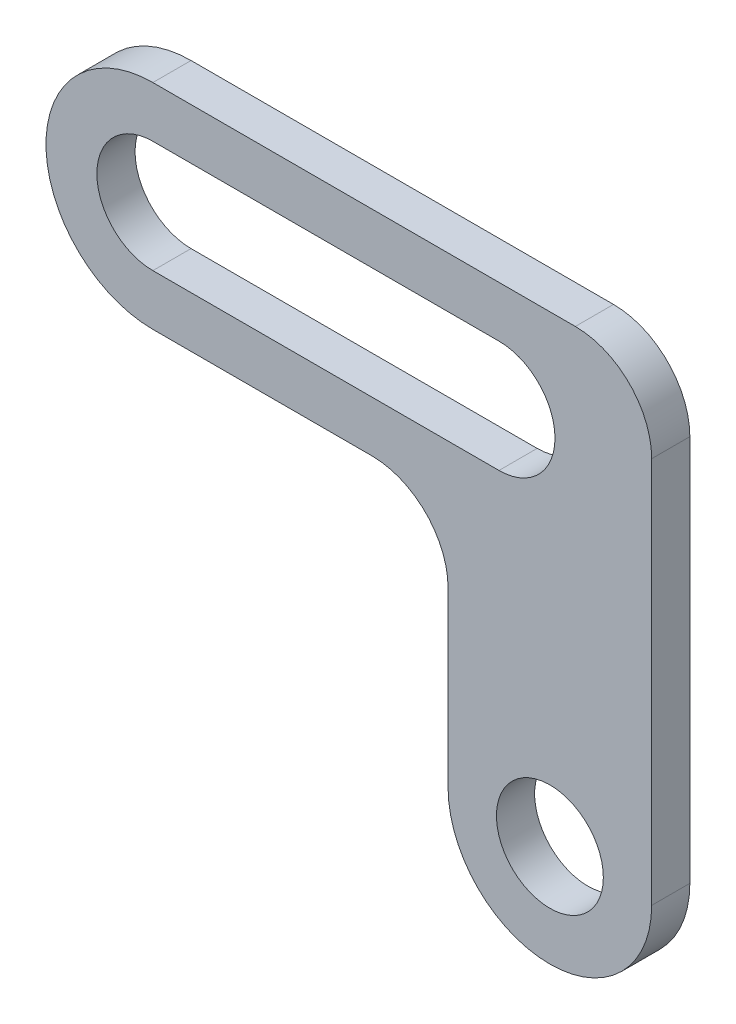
from build123d import *

# Parameters (mm, degrees)
ESQUISSE1_R        = 21
BOSS_EXTRU_1_DEPTH = 15
CONG_1_R           = 30


with BuildPart() as part:
    # Esquisse1 → Boss.-Extru.1 (new body)
    with BuildSketch(Plane.XY):
        with BuildLine():
            Line((40, 0), (40, 182))
            Line((40, 182), (-156, 182))
            ThreePointArc((-156, 182), (-198, 140), (-156, 98))
            Line((-156, 98), (-40, 98))
            Line((-40, 98), (-40, 0))
            ThreePointArc((-40, 0), (0, -40), (40, 0))
        make_face()
        Circle(ESQUISSE1_R, mode=Mode.SUBTRACT)
        with BuildLine():
            Line((-156, 162), (-20, 162))
            ThreePointArc((-20, 162), (2, 140), (-20, 118))
            Line((-20, 118), (-156, 118))
            ThreePointArc((-156, 118), (-178, 140), (-156, 162))
        make_face(mode=Mode.SUBTRACT)
    extrude(amount=BOSS_EXTRU_1_DEPTH)

    # Cong_1
    cong_1_edges = [part.edges().sort_by_distance(p)[0] for p in [
        (-40, 98, 7.5),
        (40, 182, 7.5),
    ]]
    fillet(cong_1_edges, radius=CONG_1_R)


solid = part.part
